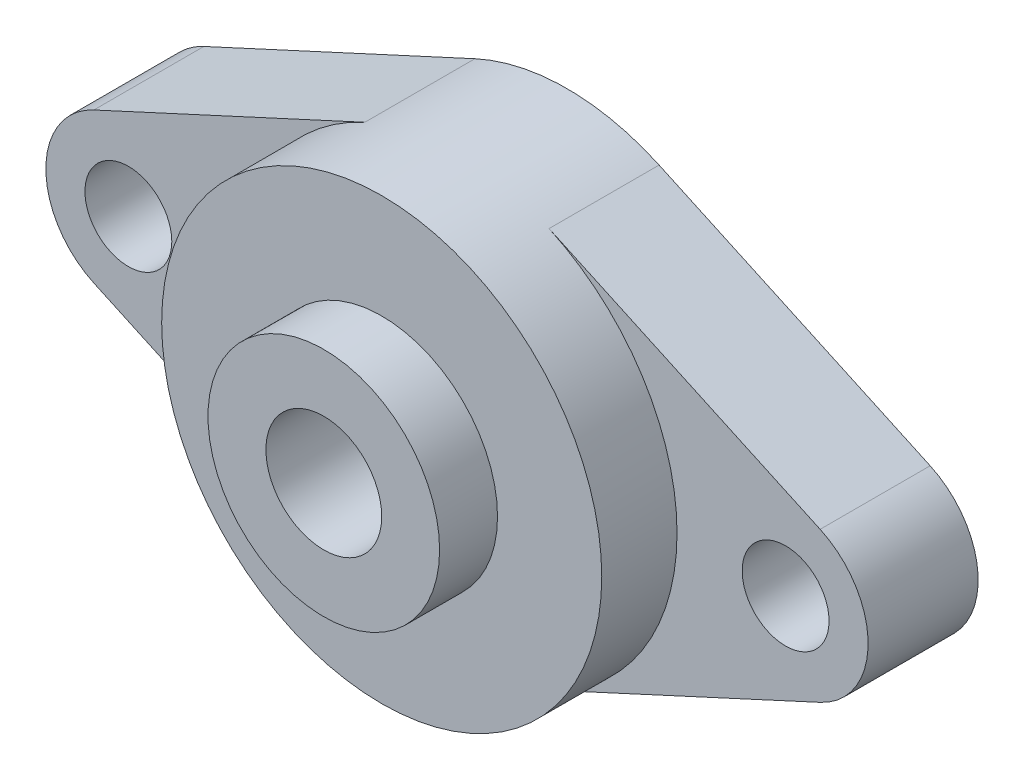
ISO-10303-21;
HEADER;
FILE_DESCRIPTION(('STEP AP214'),'2;1');
FILE_NAME('part.step','',(''),(''),'','','');
FILE_SCHEMA(('AUTOMOTIVE_DESIGN { 1 0 10303 214 1 1 1 1 }'));
ENDSEC;
DATA;
#1=APPLICATION_CONTEXT('core data for automotive mechanical design processes');
#2=APPLICATION_PROTOCOL_DEFINITION('international standard','automotive_design',2000,#1);
#3=PRODUCT_CONTEXT('',#1,'mechanical');
#4=PRODUCT('Part','Part','',(#3));
#5=PRODUCT_RELATED_PRODUCT_CATEGORY('part','',(#4));
#6=PRODUCT_DEFINITION_FORMATION('','',#4);
#7=PRODUCT_DEFINITION_CONTEXT('part definition',#1,'design');
#8=PRODUCT_DEFINITION('design','',#6,#7);
#9=PRODUCT_DEFINITION_SHAPE('','',#8);
#10=(LENGTH_UNIT() NAMED_UNIT(*) SI_UNIT(.MILLI.,.METRE.));
#11=(NAMED_UNIT(*) PLANE_ANGLE_UNIT() SI_UNIT($,.RADIAN.));
#12=(NAMED_UNIT(*) SI_UNIT($,.STERADIAN.) SOLID_ANGLE_UNIT());
#13=UNCERTAINTY_MEASURE_WITH_UNIT(LENGTH_MEASURE(1.E-05),#10,'distance_accuracy_value','');
#14=(GEOMETRIC_REPRESENTATION_CONTEXT(3) GLOBAL_UNCERTAINTY_ASSIGNED_CONTEXT((#13)) GLOBAL_UNIT_ASSIGNED_CONTEXT((#10,
#11,#12)) REPRESENTATION_CONTEXT('',''));
#15=CARTESIAN_POINT('',(0.,0.,0.));
#16=DIRECTION('',(0.,0.,1.));
#17=DIRECTION('',(1.,0.,0.));
#18=AXIS2_PLACEMENT_3D('',#15,#16,#17);
#19=CARTESIAN_POINT('',(0.,0.,0.));
#20=DIRECTION('',(0.,0.,1.));
#21=DIRECTION('',(1.,0.,0.));
#22=AXIS2_PLACEMENT_3D('',#19,#20,#21);
#23=PLANE('',#22);
#24=CARTESIAN_POINT('',(-45.0453125,0.,0.));
#25=DIRECTION('',(0.,0.,1.));
#26=DIRECTION('',(1.,0.,0.));
#27=AXIS2_PLACEMENT_3D('',#24,#25,#26);
#28=CIRCLE('',#27,5.953125);
#29=CARTESIAN_POINT('',(-39.0921875,0.,0.));
#30=VERTEX_POINT('',#29);
#31=EDGE_CURVE('E193',#30,#30,#28,.T.);
#32=ORIENTED_EDGE('',*,*,#31,.F.);
#33=EDGE_LOOP('',(#32));
#34=FACE_BOUND('',#33,.T.);
#35=CARTESIAN_POINT('',(0.,0.,0.));
#36=DIRECTION('',(0.,0.,1.));
#37=DIRECTION('',(1.,0.,0.));
#38=AXIS2_PLACEMENT_3D('',#35,#36,#37);
#39=CIRCLE('',#38,30.1625);
#40=CARTESIAN_POINT('',(-12.6230726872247,27.3940585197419,0.));
#41=VERTEX_POINT('',#40);
#42=CARTESIAN_POINT('',(-12.6230726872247,-27.3940585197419,0.));
#43=VERTEX_POINT('',#42);
#44=EDGE_CURVE('E11',#41,#43,#39,.T.);
#45=ORIENTED_EDGE('',*,*,#44,.F.);
#46=DIRECTION('',(0.908215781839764,0.418502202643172,0.));
#47=VECTOR('',#46,1.);
#48=CARTESIAN_POINT('',(-12.6230726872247,27.3940585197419,0.));
#49=LINE('',#48,#47);
#50=CARTESIAN_POINT('',(-49.7789647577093,10.2727719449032,0.));
#51=VERTEX_POINT('',#50);
#52=EDGE_CURVE('E132',#51,#41,#49,.T.);
#53=ORIENTED_EDGE('',*,*,#52,.F.);
#54=CARTESIAN_POINT('',(-45.0453125,0.,0.));
#55=DIRECTION('',(0.,0.,1.));
#56=DIRECTION('',(1.,0.,0.));
#57=AXIS2_PLACEMENT_3D('',#54,#55,#56);
#58=CIRCLE('',#57,11.3109375);
#59=CARTESIAN_POINT('',(-49.7789647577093,-10.2727719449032,0.));
#60=VERTEX_POINT('',#59);
#61=EDGE_CURVE('E135',#51,#60,#58,.T.);
#62=ORIENTED_EDGE('',*,*,#61,.T.);
#63=DIRECTION('',(0.908215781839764,-0.418502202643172,0.));
#64=VECTOR('',#63,1.);
#65=CARTESIAN_POINT('',(-12.6230726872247,-27.3940585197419,0.));
#66=LINE('',#65,#64);
#67=EDGE_CURVE('E139',#60,#43,#66,.T.);
#68=ORIENTED_EDGE('',*,*,#67,.T.);
#69=EDGE_LOOP('',(#45,#53,#62,#68));
#70=FACE_BOUND('',#69,.T.);
#71=ADVANCED_FACE('F32',(#34,#70),#23,.T.);
#72=CARTESIAN_POINT('',(-12.6230726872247,27.3940585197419,-15.08125));
#73=DIRECTION('',(0.418502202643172,-0.908215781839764,0.));
#74=DIRECTION('',(0.908215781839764,0.418502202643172,0.));
#75=AXIS2_PLACEMENT_3D('',#72,#73,#74);
#76=PLANE('',#75);
#77=ORIENTED_EDGE('',*,*,#52,.T.);
#78=DIRECTION('',(0.,0.,1.));
#79=VECTOR('',#78,1.);
#80=CARTESIAN_POINT('',(-12.6230726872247,27.3940585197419,-15.08125));
#81=LINE('',#80,#79);
#82=CARTESIAN_POINT('',(-12.6230726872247,27.3940585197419,-15.08125));
#83=VERTEX_POINT('',#82);
#84=EDGE_CURVE('E147',#83,#41,#81,.T.);
#85=ORIENTED_EDGE('',*,*,#84,.F.);
#86=DIRECTION('',(0.908215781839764,0.418502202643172,0.));
#87=VECTOR('',#86,1.);
#88=CARTESIAN_POINT('',(-12.6230726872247,27.3940585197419,-15.08125));
#89=LINE('',#88,#87);
#90=CARTESIAN_POINT('',(-49.7789647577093,10.2727719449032,-15.08125));
#91=VERTEX_POINT('',#90);
#92=EDGE_CURVE('E51',#91,#83,#89,.T.);
#93=ORIENTED_EDGE('',*,*,#92,.F.);
#94=DIRECTION('',(0.,0.,1.));
#95=VECTOR('',#94,1.);
#96=CARTESIAN_POINT('',(-49.7789647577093,10.2727719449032,-15.08125));
#97=LINE('',#96,#95);
#98=EDGE_CURVE('E36',#91,#51,#97,.T.);
#99=ORIENTED_EDGE('',*,*,#98,.T.);
#100=EDGE_LOOP('',(#77,#85,#93,#99));
#101=FACE_BOUND('',#100,.T.);
#102=ADVANCED_FACE('F34',(#101),#76,.F.);
#103=CARTESIAN_POINT('',(0.,0.,-15.08125));
#104=DIRECTION('',(0.,0.,1.));
#105=DIRECTION('',(1.,0.,0.));
#106=AXIS2_PLACEMENT_3D('',#103,#104,#105);
#107=CYLINDRICAL_SURFACE('',#106,30.1625);
#108=ORIENTED_EDGE('',*,*,#84,.T.);
#109=ORIENTED_EDGE('',*,*,#44,.T.);
#110=DIRECTION('',(0.,0.,1.));
#111=VECTOR('',#110,1.);
#112=CARTESIAN_POINT('',(-12.6230726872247,-27.3940585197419,-15.08125));
#113=LINE('',#112,#111);
#114=CARTESIAN_POINT('',(-12.6230726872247,-27.3940585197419,-15.08125));
#115=VERTEX_POINT('',#114);
#116=EDGE_CURVE('E154',#115,#43,#113,.T.);
#117=ORIENTED_EDGE('',*,*,#116,.F.);
#118=CARTESIAN_POINT('',(0.,0.,-15.08125));
#119=DIRECTION('',(0.,0.,1.));
#120=DIRECTION('',(1.,0.,0.));
#121=AXIS2_PLACEMENT_3D('',#118,#119,#120);
#122=CIRCLE('',#121,30.1625);
#123=CARTESIAN_POINT('',(12.6230726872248,-27.3940585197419,-15.08125));
#124=VERTEX_POINT('',#123);
#125=EDGE_CURVE('E128',#115,#124,#122,.T.);
#126=ORIENTED_EDGE('',*,*,#125,.T.);
#127=DIRECTION('',(0.,0.,1.));
#128=VECTOR('',#127,1.);
#129=CARTESIAN_POINT('',(12.6230726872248,-27.3940585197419,-15.08125));
#130=LINE('',#129,#128);
#131=CARTESIAN_POINT('',(12.6230726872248,-27.3940585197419,0.));
#132=VERTEX_POINT('',#131);
#133=EDGE_CURVE('E151',#124,#132,#130,.T.);
#134=ORIENTED_EDGE('',*,*,#133,.T.);
#135=CARTESIAN_POINT('',(12.6230726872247,27.3940585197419,0.));
#136=VERTEX_POINT('',#135);
#137=EDGE_CURVE('E42',#132,#136,#39,.T.);
#138=ORIENTED_EDGE('',*,*,#137,.T.);
#139=DIRECTION('',(0.,0.,1.));
#140=VECTOR('',#139,1.);
#141=CARTESIAN_POINT('',(12.6230726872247,27.3940585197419,-15.08125));
#142=LINE('',#141,#140);
#143=CARTESIAN_POINT('',(12.6230726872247,27.3940585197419,-15.08125));
#144=VERTEX_POINT('',#143);
#145=EDGE_CURVE('E114',#144,#136,#142,.T.);
#146=ORIENTED_EDGE('',*,*,#145,.F.);
#147=EDGE_CURVE('E123',#144,#83,#122,.T.);
#148=ORIENTED_EDGE('',*,*,#147,.T.);
#149=EDGE_LOOP('',(#108,#109,#117,#126,#134,#138,#146,#148));
#150=FACE_BOUND('',#149,.T.);
#151=CARTESIAN_POINT('',(0.,0.,10.31875));
#152=DIRECTION('',(0.,0.,1.));
#153=DIRECTION('',(1.,0.,0.));
#154=AXIS2_PLACEMENT_3D('',#151,#152,#153);
#155=CIRCLE('',#154,30.1625);
#156=CARTESIAN_POINT('',(30.1625,0.,10.31875));
#157=VERTEX_POINT('',#156);
#158=EDGE_CURVE('E136',#157,#157,#155,.T.);
#159=ORIENTED_EDGE('',*,*,#158,.F.);
#160=EDGE_LOOP('',(#159));
#161=FACE_BOUND('',#160,.T.);
#162=ADVANCED_FACE('F205',(#150,#161),#107,.T.);
#163=CARTESIAN_POINT('',(12.6230726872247,27.3940585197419,-15.08125));
#164=DIRECTION('',(0.418502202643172,0.908215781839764,0.));
#165=DIRECTION('',(-0.908215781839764,0.418502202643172,0.));
#166=AXIS2_PLACEMENT_3D('',#163,#164,#165);
#167=PLANE('',#166);
#168=DIRECTION('',(-0.908215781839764,0.418502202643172,0.));
#169=VECTOR('',#168,1.);
#170=CARTESIAN_POINT('',(12.6230726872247,27.3940585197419,0.));
#171=LINE('',#170,#169);
#172=CARTESIAN_POINT('',(49.7789647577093,10.2727719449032,0.));
#173=VERTEX_POINT('',#172);
#174=EDGE_CURVE('E112',#173,#136,#171,.T.);
#175=ORIENTED_EDGE('',*,*,#174,.F.);
#176=DIRECTION('',(0.,0.,1.));
#177=VECTOR('',#176,1.);
#178=CARTESIAN_POINT('',(49.7789647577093,10.2727719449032,-15.08125));
#179=LINE('',#178,#177);
#180=CARTESIAN_POINT('',(49.7789647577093,10.2727719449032,-15.08125));
#181=VERTEX_POINT('',#180);
#182=EDGE_CURVE('E79',#181,#173,#179,.T.);
#183=ORIENTED_EDGE('',*,*,#182,.F.);
#184=DIRECTION('',(-0.908215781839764,0.418502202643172,0.));
#185=VECTOR('',#184,1.);
#186=CARTESIAN_POINT('',(12.6230726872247,27.3940585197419,-15.08125));
#187=LINE('',#186,#185);
#188=EDGE_CURVE('E110',#181,#144,#187,.T.);
#189=ORIENTED_EDGE('',*,*,#188,.T.);
#190=ORIENTED_EDGE('',*,*,#145,.T.);
#191=EDGE_LOOP('',(#175,#183,#189,#190));
#192=FACE_BOUND('',#191,.T.);
#193=ADVANCED_FACE('F108',(#192),#167,.T.);
#194=CARTESIAN_POINT('',(45.0453125,0.,-15.08125));
#195=DIRECTION('',(0.,0.,1.));
#196=DIRECTION('',(1.,0.,0.));
#197=AXIS2_PLACEMENT_3D('',#194,#195,#196);
#198=CYLINDRICAL_SURFACE('',#197,11.3109375);
#199=CARTESIAN_POINT('',(45.0453125,0.,0.));
#200=DIRECTION('',(0.,0.,1.));
#201=DIRECTION('',(1.,0.,0.));
#202=AXIS2_PLACEMENT_3D('',#199,#200,#201);
#203=CIRCLE('',#202,11.3109375);
#204=CARTESIAN_POINT('',(49.7789647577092,-10.2727719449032,0.));
#205=VERTEX_POINT('',#204);
#206=EDGE_CURVE('E144',#205,#173,#203,.T.);
#207=ORIENTED_EDGE('',*,*,#206,.F.);
#208=DIRECTION('',(0.,0.,1.));
#209=VECTOR('',#208,1.);
#210=CARTESIAN_POINT('',(49.7789647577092,-10.2727719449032,-15.08125));
#211=LINE('',#210,#209);
#212=CARTESIAN_POINT('',(49.7789647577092,-10.2727719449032,-15.08125));
#213=VERTEX_POINT('',#212);
#214=EDGE_CURVE('E115',#213,#205,#211,.T.);
#215=ORIENTED_EDGE('',*,*,#214,.F.);
#216=CARTESIAN_POINT('',(45.0453125,0.,-15.08125));
#217=DIRECTION('',(0.,0.,1.));
#218=DIRECTION('',(1.,0.,0.));
#219=AXIS2_PLACEMENT_3D('',#216,#217,#218);
#220=CIRCLE('',#219,11.3109375);
#221=EDGE_CURVE('E120',#213,#181,#220,.T.);
#222=ORIENTED_EDGE('',*,*,#221,.T.);
#223=ORIENTED_EDGE('',*,*,#182,.T.);
#224=EDGE_LOOP('',(#207,#215,#222,#223));
#225=FACE_BOUND('',#224,.T.);
#226=ADVANCED_FACE('F125',(#225),#198,.T.);
#227=CARTESIAN_POINT('',(12.6230726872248,-27.3940585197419,-15.08125));
#228=DIRECTION('',(0.418502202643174,-0.908215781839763,0.));
#229=DIRECTION('',(0.908215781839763,0.418502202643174,0.));
#230=AXIS2_PLACEMENT_3D('',#227,#228,#229);
#231=PLANE('',#230);
#232=DIRECTION('',(0.908215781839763,0.418502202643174,0.));
#233=VECTOR('',#232,1.);
#234=CARTESIAN_POINT('',(12.6230726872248,-27.3940585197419,0.));
#235=LINE('',#234,#233);
#236=EDGE_CURVE('E141',#132,#205,#235,.T.);
#237=ORIENTED_EDGE('',*,*,#236,.F.);
#238=ORIENTED_EDGE('',*,*,#133,.F.);
#239=DIRECTION('',(0.908215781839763,0.418502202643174,0.));
#240=VECTOR('',#239,1.);
#241=CARTESIAN_POINT('',(12.6230726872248,-27.3940585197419,-15.08125));
#242=LINE('',#241,#240);
#243=EDGE_CURVE('E126',#124,#213,#242,.T.);
#244=ORIENTED_EDGE('',*,*,#243,.T.);
#245=ORIENTED_EDGE('',*,*,#214,.T.);
#246=EDGE_LOOP('',(#237,#238,#244,#245));
#247=FACE_BOUND('',#246,.T.);
#248=ADVANCED_FACE('F226',(#247),#231,.T.);
#249=CARTESIAN_POINT('',(-12.6230726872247,-27.3940585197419,-15.08125));
#250=DIRECTION('',(-0.418502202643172,-0.908215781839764,0.));
#251=DIRECTION('',(0.908215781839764,-0.418502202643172,0.));
#252=AXIS2_PLACEMENT_3D('',#249,#250,#251);
#253=PLANE('',#252);
#254=ORIENTED_EDGE('',*,*,#67,.F.);
#255=DIRECTION('',(0.,0.,1.));
#256=VECTOR('',#255,1.);
#257=CARTESIAN_POINT('',(-49.7789647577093,-10.2727719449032,-15.08125));
#258=LINE('',#257,#256);
#259=CARTESIAN_POINT('',(-49.7789647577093,-10.2727719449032,-15.08125));
#260=VERTEX_POINT('',#259);
#261=EDGE_CURVE('E155',#260,#60,#258,.T.);
#262=ORIENTED_EDGE('',*,*,#261,.F.);
#263=DIRECTION('',(0.908215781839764,-0.418502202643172,0.));
#264=VECTOR('',#263,1.);
#265=CARTESIAN_POINT('',(-12.6230726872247,-27.3940585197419,-15.08125));
#266=LINE('',#265,#264);
#267=EDGE_CURVE('E161',#260,#115,#266,.T.);
#268=ORIENTED_EDGE('',*,*,#267,.T.);
#269=ORIENTED_EDGE('',*,*,#116,.T.);
#270=EDGE_LOOP('',(#254,#262,#268,#269));
#271=FACE_BOUND('',#270,.T.);
#272=ADVANCED_FACE('F228',(#271),#253,.T.);
#273=CARTESIAN_POINT('',(-45.0453125,0.,-15.08125));
#274=DIRECTION('',(0.,0.,1.));
#275=DIRECTION('',(1.,0.,0.));
#276=AXIS2_PLACEMENT_3D('',#273,#274,#275);
#277=CYLINDRICAL_SURFACE('',#276,11.3109375);
#278=ORIENTED_EDGE('',*,*,#61,.F.);
#279=ORIENTED_EDGE('',*,*,#98,.F.);
#280=CARTESIAN_POINT('',(-45.0453125,0.,-15.08125));
#281=DIRECTION('',(0.,0.,1.));
#282=DIRECTION('',(1.,0.,0.));
#283=AXIS2_PLACEMENT_3D('',#280,#281,#282);
#284=CIRCLE('',#283,11.3109375);
#285=EDGE_CURVE('E164',#91,#260,#284,.T.);
#286=ORIENTED_EDGE('',*,*,#285,.T.);
#287=ORIENTED_EDGE('',*,*,#261,.T.);
#288=EDGE_LOOP('',(#278,#279,#286,#287));
#289=FACE_BOUND('',#288,.T.);
#290=ADVANCED_FACE('F218',(#289),#277,.T.);
#291=CARTESIAN_POINT('',(0.,0.,-15.08125));
#292=DIRECTION('',(0.,0.,1.));
#293=DIRECTION('',(1.,0.,0.));
#294=AXIS2_PLACEMENT_3D('',#291,#292,#293);
#295=PLANE('',#294);
#296=CARTESIAN_POINT('',(-45.0453125,0.,-15.08125));
#297=DIRECTION('',(0.,0.,1.));
#298=DIRECTION('',(1.,0.,0.));
#299=AXIS2_PLACEMENT_3D('',#296,#297,#298);
#300=CIRCLE('',#299,5.953125);
#301=CARTESIAN_POINT('',(-39.0921875,0.,-15.08125));
#302=VERTEX_POINT('',#301);
#303=EDGE_CURVE('E190',#302,#302,#300,.T.);
#304=ORIENTED_EDGE('',*,*,#303,.T.);
#305=EDGE_LOOP('',(#304));
#306=FACE_BOUND('',#305,.T.);
#307=CARTESIAN_POINT('',(45.0453125,0.,-15.08125));
#308=DIRECTION('',(0.,0.,1.));
#309=DIRECTION('',(1.,0.,0.));
#310=AXIS2_PLACEMENT_3D('',#307,#308,#309);
#311=CIRCLE('',#310,5.953125);
#312=CARTESIAN_POINT('',(50.9984375,0.,-15.08125));
#313=VERTEX_POINT('',#312);
#314=EDGE_CURVE('E184',#313,#313,#311,.T.);
#315=ORIENTED_EDGE('',*,*,#314,.T.);
#316=EDGE_LOOP('',(#315));
#317=FACE_BOUND('',#316,.T.);
#318=CARTESIAN_POINT('',(0.,0.,-15.08125));
#319=DIRECTION('',(0.,0.,1.));
#320=DIRECTION('',(1.,0.,0.));
#321=AXIS2_PLACEMENT_3D('',#318,#319,#320);
#322=CIRCLE('',#321,7.93749999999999);
#323=CARTESIAN_POINT('',(7.93749999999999,0.,-15.08125));
#324=VERTEX_POINT('',#323);
#325=EDGE_CURVE('E176',#324,#324,#322,.T.);
#326=ORIENTED_EDGE('',*,*,#325,.T.);
#327=EDGE_LOOP('',(#326));
#328=FACE_BOUND('',#327,.T.);
#329=ORIENTED_EDGE('',*,*,#92,.T.);
#330=ORIENTED_EDGE('',*,*,#147,.F.);
#331=ORIENTED_EDGE('',*,*,#188,.F.);
#332=ORIENTED_EDGE('',*,*,#221,.F.);
#333=ORIENTED_EDGE('',*,*,#243,.F.);
#334=ORIENTED_EDGE('',*,*,#125,.F.);
#335=ORIENTED_EDGE('',*,*,#267,.F.);
#336=ORIENTED_EDGE('',*,*,#285,.F.);
#337=EDGE_LOOP('',(#329,#330,#331,#332,#333,#334,#335,#336));
#338=FACE_BOUND('',#337,.T.);
#339=ADVANCED_FACE('F118',(#306,#317,#328,#338),#295,.F.);
#340=CARTESIAN_POINT('',(45.0453125,0.,0.));
#341=DIRECTION('',(0.,0.,1.));
#342=DIRECTION('',(1.,0.,0.));
#343=AXIS2_PLACEMENT_3D('',#340,#341,#342);
#344=CIRCLE('',#343,5.953125);
#345=CARTESIAN_POINT('',(50.9984375,0.,0.));
#346=VERTEX_POINT('',#345);
#347=EDGE_CURVE('E187',#346,#346,#344,.T.);
#348=ORIENTED_EDGE('',*,*,#347,.F.);
#349=EDGE_LOOP('',(#348));
#350=FACE_BOUND('',#349,.T.);
#351=ORIENTED_EDGE('',*,*,#137,.F.);
#352=ORIENTED_EDGE('',*,*,#236,.T.);
#353=ORIENTED_EDGE('',*,*,#206,.T.);
#354=ORIENTED_EDGE('',*,*,#174,.T.);
#355=EDGE_LOOP('',(#351,#352,#353,#354));
#356=FACE_BOUND('',#355,.T.);
#357=ADVANCED_FACE('F201',(#350,#356),#23,.T.);
#358=CARTESIAN_POINT('',(0.,0.,10.31875));
#359=DIRECTION('',(0.,0.,1.));
#360=DIRECTION('',(1.,0.,0.));
#361=AXIS2_PLACEMENT_3D('',#358,#359,#360);
#362=PLANE('',#361);
#363=CARTESIAN_POINT('',(0.,0.,10.31875));
#364=DIRECTION('',(0.,0.,1.));
#365=DIRECTION('',(1.,0.,0.));
#366=AXIS2_PLACEMENT_3D('',#363,#364,#365);
#367=CIRCLE('',#366,15.875);
#368=CARTESIAN_POINT('',(15.875,0.,10.31875));
#369=VERTEX_POINT('',#368);
#370=EDGE_CURVE('E173',#369,#369,#367,.T.);
#371=ORIENTED_EDGE('',*,*,#370,.F.);
#372=EDGE_LOOP('',(#371));
#373=FACE_BOUND('',#372,.T.);
#374=ORIENTED_EDGE('',*,*,#158,.T.);
#375=EDGE_LOOP('',(#374));
#376=FACE_BOUND('',#375,.T.);
#377=ADVANCED_FACE('F209',(#373,#376),#362,.T.);
#378=CARTESIAN_POINT('',(0.,0.,18.25625));
#379=DIRECTION('',(0.,0.,-1.));
#380=DIRECTION('',(-1.,0.,0.));
#381=AXIS2_PLACEMENT_3D('',#378,#379,#380);
#382=CYLINDRICAL_SURFACE('',#381,15.875);
#383=CARTESIAN_POINT('',(0.,0.,18.25625));
#384=DIRECTION('',(0.,0.,1.));
#385=DIRECTION('',(1.,0.,0.));
#386=AXIS2_PLACEMENT_3D('',#383,#384,#385);
#387=CIRCLE('',#386,15.875);
#388=CARTESIAN_POINT('',(15.875,0.,18.25625));
#389=VERTEX_POINT('',#388);
#390=EDGE_CURVE('E172',#389,#389,#387,.T.);
#391=ORIENTED_EDGE('',*,*,#390,.F.);
#392=EDGE_LOOP('',(#391));
#393=FACE_BOUND('',#392,.T.);
#394=ORIENTED_EDGE('',*,*,#370,.T.);
#395=EDGE_LOOP('',(#394));
#396=FACE_BOUND('',#395,.T.);
#397=ADVANCED_FACE('F215',(#393,#396),#382,.T.);
#398=CARTESIAN_POINT('',(0.,0.,18.25625));
#399=DIRECTION('',(0.,0.,1.));
#400=DIRECTION('',(1.,0.,0.));
#401=AXIS2_PLACEMENT_3D('',#398,#399,#400);
#402=PLANE('',#401);
#403=CARTESIAN_POINT('',(0.,0.,18.25625));
#404=DIRECTION('',(0.,0.,1.));
#405=DIRECTION('',(1.,0.,0.));
#406=AXIS2_PLACEMENT_3D('',#403,#404,#405);
#407=CIRCLE('',#406,7.9375);
#408=CARTESIAN_POINT('',(7.9375,0.,18.25625));
#409=VERTEX_POINT('',#408);
#410=EDGE_CURVE('E181',#409,#409,#407,.T.);
#411=ORIENTED_EDGE('',*,*,#410,.F.);
#412=EDGE_LOOP('',(#411));
#413=FACE_BOUND('',#412,.T.);
#414=ORIENTED_EDGE('',*,*,#390,.T.);
#415=EDGE_LOOP('',(#414));
#416=FACE_BOUND('',#415,.T.);
#417=ADVANCED_FACE('F276',(#413,#416),#402,.T.);
#418=CARTESIAN_POINT('',(0.,0.,18.25625));
#419=DIRECTION('',(0.,0.,1.));
#420=DIRECTION('',(1.,0.,0.));
#421=AXIS2_PLACEMENT_3D('',#418,#419,#420);
#422=CYLINDRICAL_SURFACE('',#421,7.93749999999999);
#423=ORIENTED_EDGE('',*,*,#325,.F.);
#424=EDGE_LOOP('',(#423));
#425=FACE_BOUND('',#424,.T.);
#426=ORIENTED_EDGE('',*,*,#410,.T.);
#427=EDGE_LOOP('',(#426));
#428=FACE_BOUND('',#427,.T.);
#429=ADVANCED_FACE('F286',(#425,#428),#422,.F.);
#430=CARTESIAN_POINT('',(45.0453125,0.,0.));
#431=DIRECTION('',(0.,0.,1.));
#432=DIRECTION('',(1.,0.,0.));
#433=AXIS2_PLACEMENT_3D('',#430,#431,#432);
#434=CYLINDRICAL_SURFACE('',#433,5.953125);
#435=ORIENTED_EDGE('',*,*,#314,.F.);
#436=EDGE_LOOP('',(#435));
#437=FACE_BOUND('',#436,.T.);
#438=ORIENTED_EDGE('',*,*,#347,.T.);
#439=EDGE_LOOP('',(#438));
#440=FACE_BOUND('',#439,.T.);
#441=ADVANCED_FACE('F295',(#437,#440),#434,.F.);
#442=CARTESIAN_POINT('',(-45.0453125,0.,0.));
#443=DIRECTION('',(0.,0.,1.));
#444=DIRECTION('',(1.,0.,0.));
#445=AXIS2_PLACEMENT_3D('',#442,#443,#444);
#446=CYLINDRICAL_SURFACE('',#445,5.953125);
#447=ORIENTED_EDGE('',*,*,#303,.F.);
#448=EDGE_LOOP('',(#447));
#449=FACE_BOUND('',#448,.T.);
#450=ORIENTED_EDGE('',*,*,#31,.T.);
#451=EDGE_LOOP('',(#450));
#452=FACE_BOUND('',#451,.T.);
#453=ADVANCED_FACE('F197',(#449,#452),#446,.F.);
#454=CLOSED_SHELL('',(#71,#102,#162,#193,#226,#248,#272,#290,#339,#357,#377,#397,#417,#429,#441,#453));
#455=MANIFOLD_SOLID_BREP('B2',#454);
#456=ADVANCED_BREP_SHAPE_REPRESENTATION('',(#18,#455),#14);
#457=SHAPE_DEFINITION_REPRESENTATION(#9,#456);
ENDSEC;
END-ISO-10303-21;
